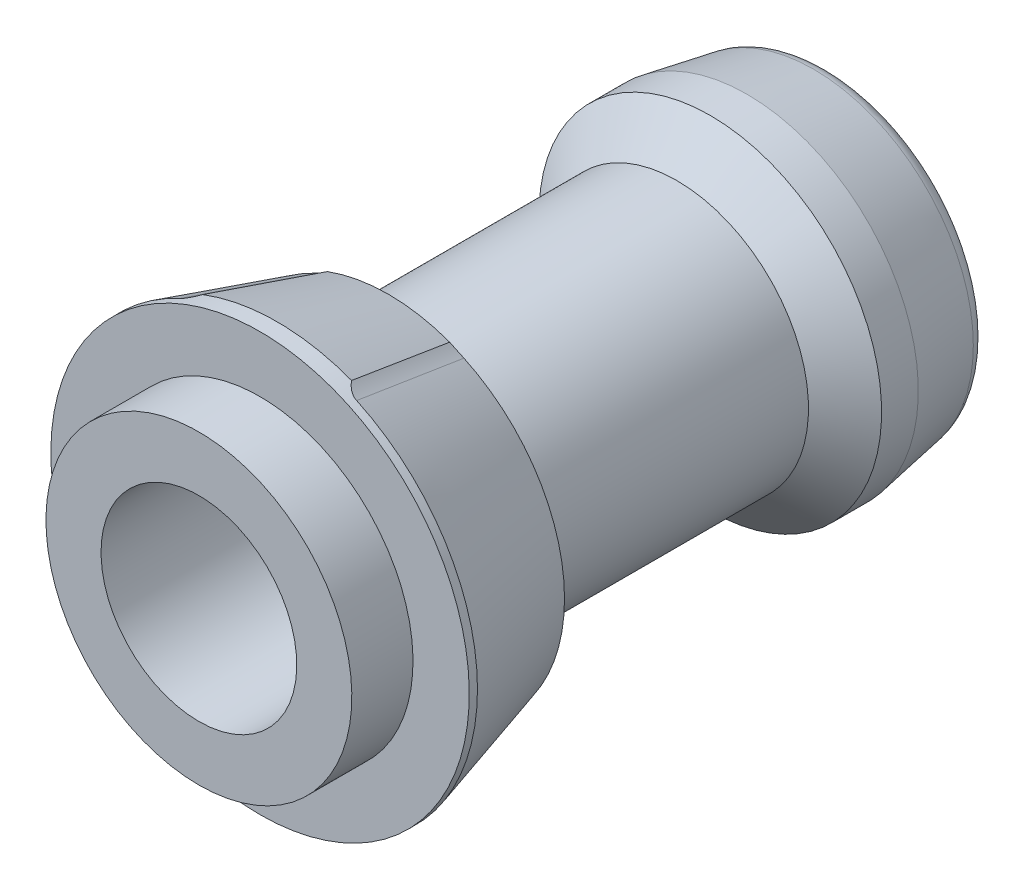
ISO-10303-21;
HEADER;
FILE_DESCRIPTION(('STEP AP214'),'2;1');
FILE_NAME('part.step','',(''),(''),'','','');
FILE_SCHEMA(('AUTOMOTIVE_DESIGN { 1 0 10303 214 1 1 1 1 }'));
ENDSEC;
DATA;
#1=APPLICATION_CONTEXT('core data for automotive mechanical design processes');
#2=APPLICATION_PROTOCOL_DEFINITION('international standard','automotive_design',2000,#1);
#3=PRODUCT_CONTEXT('',#1,'mechanical');
#4=PRODUCT('Part','Part','',(#3));
#5=PRODUCT_RELATED_PRODUCT_CATEGORY('part','',(#4));
#6=PRODUCT_DEFINITION_FORMATION('','',#4);
#7=PRODUCT_DEFINITION_CONTEXT('part definition',#1,'design');
#8=PRODUCT_DEFINITION('design','',#6,#7);
#9=PRODUCT_DEFINITION_SHAPE('','',#8);
#10=(LENGTH_UNIT() NAMED_UNIT(*) SI_UNIT(.MILLI.,.METRE.));
#11=(NAMED_UNIT(*) PLANE_ANGLE_UNIT() SI_UNIT($,.RADIAN.));
#12=(NAMED_UNIT(*) SI_UNIT($,.STERADIAN.) SOLID_ANGLE_UNIT());
#13=UNCERTAINTY_MEASURE_WITH_UNIT(LENGTH_MEASURE(1.E-05),#10,'distance_accuracy_value','');
#14=(GEOMETRIC_REPRESENTATION_CONTEXT(3) GLOBAL_UNCERTAINTY_ASSIGNED_CONTEXT((#13)) GLOBAL_UNIT_ASSIGNED_CONTEXT((#10,
#11,#12)) REPRESENTATION_CONTEXT('',''));
#15=CARTESIAN_POINT('',(0.,0.,0.));
#16=DIRECTION('',(0.,0.,1.));
#17=DIRECTION('',(1.,0.,0.));
#18=AXIS2_PLACEMENT_3D('',#15,#16,#17);
#19=CARTESIAN_POINT('',(0.,0.,5.));
#20=DIRECTION('',(0.,0.,1.));
#21=DIRECTION('',(0.,-1.,0.));
#22=AXIS2_PLACEMENT_3D('',#19,#20,#21);
#23=CYLINDRICAL_SURFACE('',#22,7.);
#24=CARTESIAN_POINT('',(0.,0.,-25.));
#25=DIRECTION('',(0.,0.,1.));
#26=DIRECTION('',(0.,-1.,0.));
#27=AXIS2_PLACEMENT_3D('',#24,#25,#26);
#28=CIRCLE('',#27,7.);
#29=CARTESIAN_POINT('',(0.,-6.99999999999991,-25.));
#30=VERTEX_POINT('',#29);
#31=EDGE_CURVE('E321',#30,#30,#28,.T.);
#32=ORIENTED_EDGE('',*,*,#31,.T.);
#33=EDGE_LOOP('',(#32));
#34=FACE_BOUND('',#33,.T.);
#35=CARTESIAN_POINT('',(0.,1.08235921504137E-13,-31.));
#36=DIRECTION('',(0.,0.,-1.));
#37=DIRECTION('',(1.,0.,0.));
#38=AXIS2_PLACEMENT_3D('',#35,#36,#37);
#39=CIRCLE('',#38,7.);
#40=CARTESIAN_POINT('',(7.,1.08235921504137E-13,-31.));
#41=VERTEX_POINT('',#40);
#42=EDGE_CURVE('E9',#41,#41,#39,.F.);
#43=ORIENTED_EDGE('',*,*,#42,.F.);
#44=EDGE_LOOP('',(#43));
#45=FACE_BOUND('',#44,.T.);
#46=ADVANCED_FACE('F14',(#34,#45),#23,.F.);
#47=CARTESIAN_POINT('',(0.,0.,0.));
#48=DIRECTION('',(0.,0.,-1.));
#49=DIRECTION('',(0.,1.,0.));
#50=AXIS2_PLACEMENT_3D('',#47,#48,#49);
#51=CYLINDRICAL_SURFACE('',#50,17.1);
#52=CARTESIAN_POINT('',(0.,0.,0.));
#53=DIRECTION('',(0.,0.,1.));
#54=DIRECTION('',(0.,-1.,0.));
#55=AXIS2_PLACEMENT_3D('',#52,#53,#54);
#56=CIRCLE('',#55,17.1);
#57=CARTESIAN_POINT('',(0.,-17.1,0.));
#58=VERTEX_POINT('',#57);
#59=EDGE_CURVE('E349',#58,#58,#56,.F.);
#60=ORIENTED_EDGE('',*,*,#59,.T.);
#61=EDGE_LOOP('',(#60));
#62=FACE_BOUND('',#61,.T.);
#63=CARTESIAN_POINT('',(0.,0.,-1.3949657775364));
#64=DIRECTION('',(0.,0.,-1.));
#65=DIRECTION('',(0.,1.,0.));
#66=AXIS2_PLACEMENT_3D('',#63,#64,#65);
#67=CIRCLE('',#66,17.1);
#68=CARTESIAN_POINT('',(-6.08241428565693,15.9816844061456,-1.39496577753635));
#69=VERTEX_POINT('',#68);
#70=CARTESIAN_POINT('',(6.08241428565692,15.9816844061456,-1.39496577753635));
#71=VERTEX_POINT('',#70);
#72=EDGE_CURVE('E331',#69,#71,#67,.T.);
#73=ORIENTED_EDGE('',*,*,#72,.F.);
#74=CARTESIAN_POINT('',(-6.08241428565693,15.9816844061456,-1.39496577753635));
#75=CARTESIAN_POINT('',(-6.11358364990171,15.9698208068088,-1.35559954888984));
#76=CARTESIAN_POINT('',(-6.14546425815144,15.9575841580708,-1.31691915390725));
#77=CARTESIAN_POINT('',(-6.21088953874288,15.9322342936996,-1.24117287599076));
#78=CARTESIAN_POINT('',(-6.24443696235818,15.919119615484,-1.20410986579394));
#79=CARTESIAN_POINT('',(-6.3489458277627,15.8778644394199,-1.09469106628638));
#80=CARTESIAN_POINT('',(-6.42273072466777,15.8482070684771,-1.02546248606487));
#81=CARTESIAN_POINT('',(-6.56178746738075,15.7910507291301,-0.913713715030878));
#82=CARTESIAN_POINT('',(-6.62538961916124,15.7644993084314,-0.86866394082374));
#83=CARTESIAN_POINT('',(-6.75771078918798,15.7082289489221,-0.790024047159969));
#84=CARTESIAN_POINT('',(-6.82639671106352,15.6785300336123,-0.756366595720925));
#85=CARTESIAN_POINT('',(-6.95174579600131,15.6232767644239,-0.710210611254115));
#86=CARTESIAN_POINT('',(-7.00753100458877,15.5983449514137,-0.694623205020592));
#87=CARTESIAN_POINT('',(-7.12045520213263,15.5471203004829,-0.673973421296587));
#88=CARTESIAN_POINT('',(-7.17759380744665,15.5208278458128,-0.668908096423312));
#89=CARTESIAN_POINT('',(-7.29156400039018,15.4676131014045,-0.669910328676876));
#90=CARTESIAN_POINT('',(-7.34839510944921,15.4406900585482,-0.675991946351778));
#91=CARTESIAN_POINT('',(-7.46001209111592,15.3870746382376,-0.698586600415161));
#92=CARTESIAN_POINT('',(-7.51479716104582,15.3603823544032,-0.715103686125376));
#93=CARTESIAN_POINT('',(-7.63943667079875,15.2988676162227,-0.764103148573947));
#94=CARTESIAN_POINT('',(-7.70805310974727,15.2643793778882,-0.800110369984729));
#95=CARTESIAN_POINT('',(-7.83923225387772,15.1974314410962,-0.883793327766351));
#96=CARTESIAN_POINT('',(-7.9017560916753,15.1649851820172,-0.93153790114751));
#97=CARTESIAN_POINT('',(-8.03102725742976,15.096980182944,-1.04391100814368));
#98=CARTESIAN_POINT('',(-8.096676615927,15.0618342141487,-1.11003032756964));
#99=CARTESIAN_POINT('',(-8.18946646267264,15.01145709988,-1.21408001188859));
#100=CARTESIAN_POINT('',(-8.2192291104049,14.9951783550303,-1.24926927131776));
#101=CARTESIAN_POINT('',(-8.27720907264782,14.9632516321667,-1.32109105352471));
#102=CARTESIAN_POINT('',(-8.30542837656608,14.9476028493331,-1.35772160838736));
#103=CARTESIAN_POINT('',(-8.33297999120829,14.932228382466,-1.39496577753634));
#104=B_SPLINE_CURVE_WITH_KNOTS('',3,(#74,#75,#76,#77,#78,#79,#80,#81,#82,#83,#84,#85,#86,#87,
#88,#89,#90,#91,#92,#93,#94,#95,#96,#97,#98,#99,#100,#101,#102,#103),.UNSPECIFIED.,.F.,.F.,(4,2,
2,2,2,2,2,2,2,2,2,2,2,2,4),(0.,0.154747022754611,0.309758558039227,0.625028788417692,
0.871317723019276,1.11612450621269,1.30450457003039,1.49283185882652,1.68139686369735,
1.87003508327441,2.12305130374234,2.37758837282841,2.67553132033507,2.82213393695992,
2.96854289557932),.UNSPECIFIED.);
#105=CARTESIAN_POINT('',(-7.22677227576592,15.4978631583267,-0.669374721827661));
#106=VERTEX_POINT('',#105);
#107=EDGE_CURVE('E181',#69,#106,#104,.T.);
#108=ORIENTED_EDGE('',*,*,#107,.T.);
#109=CARTESIAN_POINT('',(0.,0.,-0.669374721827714));
#110=DIRECTION('',(0.,0.,1.));
#111=DIRECTION('',(0.,-1.,0.));
#112=AXIS2_PLACEMENT_3D('',#109,#110,#111);
#113=CIRCLE('',#112,17.1);
#114=CARTESIAN_POINT('',(-7.22677227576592,-15.4978631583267,-0.669374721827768));
#115=VERTEX_POINT('',#114);
#116=EDGE_CURVE('E264',#115,#106,#113,.F.);
#117=ORIENTED_EDGE('',*,*,#116,.F.);
#118=CARTESIAN_POINT('',(-8.33297999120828,-14.932228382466,-1.39496577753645));
#119=CARTESIAN_POINT('',(-8.30385666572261,-14.9484797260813,-1.35559954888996));
#120=CARTESIAN_POINT('',(-8.27399038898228,-14.9650361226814,-1.31691915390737));
#121=CARTESIAN_POINT('',(-8.21251670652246,-14.9988602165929,-1.24117287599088));
#122=CARTESIAN_POINT('',(-8.18090641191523,-15.0161290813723,-1.20410986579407));
#123=CARTESIAN_POINT('',(-8.08212610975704,-15.0696692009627,-1.09469106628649));
#124=CARTESIAN_POINT('',(-8.01197922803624,-15.107128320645,-1.02546248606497));
#125=CARTESIAN_POINT('',(-7.87881098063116,-15.1769125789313,-0.913713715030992));
#126=CARTESIAN_POINT('',(-7.8175887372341,-15.2085677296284,-0.868663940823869));
#127=CARTESIAN_POINT('',(-7.68942873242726,-15.2737617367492,-0.790024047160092));
#128=CARTESIAN_POINT('',(-7.62252758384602,-15.3072881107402,-0.756366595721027));
#129=CARTESIAN_POINT('',(-7.49962828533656,-15.3677949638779,-0.71021061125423));
#130=CARTESIAN_POINT('',(-7.4446713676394,-15.3945030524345,-0.694623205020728));
#131=CARTESIAN_POINT('',(-7.33284473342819,-15.4480814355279,-0.67397342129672));
#132=CARTESIAN_POINT('',(-7.27597555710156,-15.474951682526,-0.66890809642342));
#133=CARTESIAN_POINT('',(-7.16195206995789,-15.5280521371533,-0.669910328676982));
#134=CARTESIAN_POINT('',(-7.10479748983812,-15.5542814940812,-0.675991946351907));
#135=CARTESIAN_POINT('',(-6.99197968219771,-15.6053217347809,-0.698586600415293));
#136=CARTESIAN_POINT('',(-6.93631704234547,-15.6301320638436,-0.715103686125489));
#137=CARTESIAN_POINT('',(-6.80907728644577,-15.6860705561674,-0.764103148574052));
#138=CARTESIAN_POINT('',(-6.73855196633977,-15.7164651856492,-0.80011036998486));
#139=CARTESIAN_POINT('',(-6.60294654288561,-15.7739209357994,-0.88379332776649));
#140=CARTESIAN_POINT('',(-6.53790171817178,-15.80096092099,-0.931537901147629));
#141=CARTESIAN_POINT('',(-6.40271296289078,-15.8562756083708,-1.04391100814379));
#142=CARTESIAN_POINT('',(-6.33359099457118,-15.8839745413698,-1.11003032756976));
#143=CARTESIAN_POINT('',(-6.23535572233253,-15.9226739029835,-1.21408001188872));
#144=CARTESIAN_POINT('',(-6.20375441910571,-15.9350096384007,-1.24926927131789));
#145=CARTESIAN_POINT('',(-6.14202832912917,-15.9589027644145,-1.32109105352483));
#146=CARTESIAN_POINT('',(-6.11190164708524,-15.9704611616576,-1.35772160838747));
#147=CARTESIAN_POINT('',(-6.08241428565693,-15.9816844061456,-1.39496577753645));
#148=B_SPLINE_CURVE_WITH_KNOTS('',3,(#118,#119,#120,#121,#122,#123,#124,#125,#126,#127,#128,
#129,#130,#131,#132,#133,#134,#135,#136,#137,#138,#139,#140,#141,#142,#143,#144,#145,#146,#147),
.UNSPECIFIED.,.F.,.F.,(4,2,2,2,2,2,2,2,2,2,2,2,2,2,4),(0.,0.154747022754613,0.309758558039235,
0.625028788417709,0.871317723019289,1.1161245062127,1.30450457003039,1.49283185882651,
1.68139686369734,1.8700350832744,2.12305130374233,2.37758837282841,2.67553132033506,
2.82213393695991,2.9685428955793),.UNSPECIFIED.);
#149=CARTESIAN_POINT('',(-6.08241428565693,-15.9816844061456,-1.39496577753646));
#150=VERTEX_POINT('',#149);
#151=EDGE_CURVE('E250',#115,#150,#148,.T.);
#152=ORIENTED_EDGE('',*,*,#151,.T.);
#153=CARTESIAN_POINT('',(6.08241428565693,-15.9816844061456,-1.39496577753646));
#154=VERTEX_POINT('',#153);
#155=EDGE_CURVE('E332',#154,#150,#67,.T.);
#156=ORIENTED_EDGE('',*,*,#155,.F.);
#157=CARTESIAN_POINT('',(6.08241428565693,-15.9816844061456,-1.39496577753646));
#158=CARTESIAN_POINT('',(6.11358364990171,-15.9698208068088,-1.35559954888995));
#159=CARTESIAN_POINT('',(6.14546425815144,-15.9575841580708,-1.31691915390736));
#160=CARTESIAN_POINT('',(6.21088953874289,-15.9322342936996,-1.24117287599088));
#161=CARTESIAN_POINT('',(6.24443696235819,-15.9191196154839,-1.20410986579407));
#162=CARTESIAN_POINT('',(6.34894582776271,-15.8778644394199,-1.0946910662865));
#163=CARTESIAN_POINT('',(6.42273072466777,-15.8482070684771,-1.02546248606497));
#164=CARTESIAN_POINT('',(6.56178746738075,-15.7910507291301,-0.913713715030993));
#165=CARTESIAN_POINT('',(6.62538961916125,-15.7644993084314,-0.868663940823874));
#166=CARTESIAN_POINT('',(6.75771078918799,-15.7082289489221,-0.790024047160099));
#167=CARTESIAN_POINT('',(6.82639671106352,-15.6785300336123,-0.756366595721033));
#168=CARTESIAN_POINT('',(6.95174579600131,-15.6232767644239,-0.710210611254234));
#169=CARTESIAN_POINT('',(7.00753100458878,-15.5983449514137,-0.694623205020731));
#170=CARTESIAN_POINT('',(7.12045520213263,-15.5471203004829,-0.673973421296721));
#171=CARTESIAN_POINT('',(7.17759380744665,-15.5208278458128,-0.668908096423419));
#172=CARTESIAN_POINT('',(7.29156400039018,-15.4676131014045,-0.669910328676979));
#173=CARTESIAN_POINT('',(7.34839510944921,-15.4406900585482,-0.675991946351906));
#174=CARTESIAN_POINT('',(7.46001209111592,-15.3870746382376,-0.698586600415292));
#175=CARTESIAN_POINT('',(7.51479716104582,-15.3603823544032,-0.715103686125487));
#176=CARTESIAN_POINT('',(7.63943667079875,-15.2988676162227,-0.76410314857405));
#177=CARTESIAN_POINT('',(7.70805310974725,-15.2643793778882,-0.800110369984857));
#178=CARTESIAN_POINT('',(7.8392322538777,-15.1974314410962,-0.883793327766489));
#179=CARTESIAN_POINT('',(7.90175609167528,-15.1649851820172,-0.931537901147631));
#180=CARTESIAN_POINT('',(8.03102725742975,-15.096980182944,-1.04391100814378));
#181=CARTESIAN_POINT('',(8.096676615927,-15.0618342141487,-1.11003032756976));
#182=CARTESIAN_POINT('',(8.18946646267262,-15.01145709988,-1.21408001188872));
#183=CARTESIAN_POINT('',(8.21922911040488,-14.9951783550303,-1.24926927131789));
#184=CARTESIAN_POINT('',(8.2772090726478,-14.9632516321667,-1.32109105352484));
#185=CARTESIAN_POINT('',(8.30542837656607,-14.947602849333,-1.35772160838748));
#186=CARTESIAN_POINT('',(8.33297999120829,-14.932228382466,-1.39496577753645));
#187=B_SPLINE_CURVE_WITH_KNOTS('',3,(#157,#158,#159,#160,#161,#162,#163,#164,#165,#166,#167,
#168,#169,#170,#171,#172,#173,#174,#175,#176,#177,#178,#179,#180,#181,#182,#183,#184,#185,#186),
.UNSPECIFIED.,.F.,.F.,(4,2,2,2,2,2,2,2,2,2,2,2,2,2,4),(0.,0.154747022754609,0.309758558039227,
0.625028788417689,0.87131772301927,1.11612450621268,1.30450457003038,1.49283185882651,
1.68139686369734,1.8700350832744,2.12305130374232,2.37758837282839,2.67553132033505,
2.8221339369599,2.9685428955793),.UNSPECIFIED.);
#188=CARTESIAN_POINT('',(7.22677227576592,-15.4978631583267,-0.669374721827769));
#189=VERTEX_POINT('',#188);
#190=EDGE_CURVE('E281',#154,#189,#187,.T.);
#191=ORIENTED_EDGE('',*,*,#190,.T.);
#192=CARTESIAN_POINT('',(0.,0.,-0.669374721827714));
#193=DIRECTION('',(0.,0.,1.));
#194=DIRECTION('',(0.,-1.,0.));
#195=AXIS2_PLACEMENT_3D('',#192,#193,#194);
#196=CIRCLE('',#195,17.1);
#197=CARTESIAN_POINT('',(7.22677227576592,15.4978631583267,-0.66937472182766));
#198=VERTEX_POINT('',#197);
#199=EDGE_CURVE('E303',#198,#189,#196,.F.);
#200=ORIENTED_EDGE('',*,*,#199,.F.);
#201=CARTESIAN_POINT('',(8.33297999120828,14.932228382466,-1.39496577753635));
#202=CARTESIAN_POINT('',(8.30385666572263,14.9484797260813,-1.35559954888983));
#203=CARTESIAN_POINT('',(8.27399038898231,14.9650361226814,-1.31691915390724));
#204=CARTESIAN_POINT('',(8.21251670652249,14.9988602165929,-1.24117287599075));
#205=CARTESIAN_POINT('',(8.18090641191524,15.0161290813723,-1.20410986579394));
#206=CARTESIAN_POINT('',(8.08212610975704,15.0696692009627,-1.09469106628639));
#207=CARTESIAN_POINT('',(8.01197922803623,15.107128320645,-1.02546248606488));
#208=CARTESIAN_POINT('',(7.87881098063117,15.1769125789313,-0.913713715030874));
#209=CARTESIAN_POINT('',(7.81758873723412,15.2085677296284,-0.868663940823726));
#210=CARTESIAN_POINT('',(7.68942873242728,15.2737617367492,-0.790024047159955));
#211=CARTESIAN_POINT('',(7.62252758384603,15.3072881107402,-0.756366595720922));
#212=CARTESIAN_POINT('',(7.49962828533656,15.3677949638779,-0.71021061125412));
#213=CARTESIAN_POINT('',(7.4446713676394,15.3945030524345,-0.694623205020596));
#214=CARTESIAN_POINT('',(7.3328447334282,15.4480814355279,-0.673973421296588));
#215=CARTESIAN_POINT('',(7.27597555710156,15.474951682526,-0.668908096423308));
#216=CARTESIAN_POINT('',(7.16195206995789,15.5280521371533,-0.66991032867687));
#217=CARTESIAN_POINT('',(7.10479748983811,15.5542814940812,-0.675991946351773));
#218=CARTESIAN_POINT('',(6.99197968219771,15.6053217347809,-0.698586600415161));
#219=CARTESIAN_POINT('',(6.93631704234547,15.6301320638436,-0.715103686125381));
#220=CARTESIAN_POINT('',(6.80907728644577,15.6860705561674,-0.764103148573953));
#221=CARTESIAN_POINT('',(6.73855196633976,15.7164651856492,-0.800110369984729));
#222=CARTESIAN_POINT('',(6.6029465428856,15.7739209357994,-0.883793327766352));
#223=CARTESIAN_POINT('',(6.53790171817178,15.80096092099,-0.931537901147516));
#224=CARTESIAN_POINT('',(6.40271296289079,15.8562756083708,-1.04391100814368));
#225=CARTESIAN_POINT('',(6.33359099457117,15.8839745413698,-1.11003032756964));
#226=CARTESIAN_POINT('',(6.23535572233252,15.9226739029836,-1.21408001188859));
#227=CARTESIAN_POINT('',(6.2037544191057,15.9350096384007,-1.24926927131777));
#228=CARTESIAN_POINT('',(6.14202832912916,15.9589027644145,-1.32109105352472));
#229=CARTESIAN_POINT('',(6.11190164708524,15.9704611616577,-1.35772160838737));
#230=CARTESIAN_POINT('',(6.08241428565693,15.9816844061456,-1.39496577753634));
#231=B_SPLINE_CURVE_WITH_KNOTS('',3,(#201,#202,#203,#204,#205,#206,#207,#208,#209,#210,#211,
#212,#213,#214,#215,#216,#217,#218,#219,#220,#221,#222,#223,#224,#225,#226,#227,#228,#229,#230),
.UNSPECIFIED.,.F.,.F.,(4,2,2,2,2,2,2,2,2,2,2,2,2,2,4),(0.,0.154747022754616,0.309758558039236,
0.625028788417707,0.871317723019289,1.11612450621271,1.3045045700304,1.49283185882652,
1.68139686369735,1.87003508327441,2.12305130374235,2.37758837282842,2.67553132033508,
2.82213393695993,2.96854289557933),.UNSPECIFIED.);
#232=EDGE_CURVE('E39',#198,#71,#231,.T.);
#233=ORIENTED_EDGE('',*,*,#232,.T.);
#234=EDGE_LOOP('',(#73,#108,#117,#152,#156,#191,#200,#233));
#235=FACE_BOUND('',#234,.T.);
#236=ADVANCED_FACE('F219',(#62,#235),#51,.T.);
#237=CARTESIAN_POINT('',(0.,0.,-12.6588127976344));
#238=DIRECTION('',(0.,0.,1.));
#239=DIRECTION('',(0.,-1.,0.));
#240=AXIS2_PLACEMENT_3D('',#237,#238,#239);
#241=CONICAL_SURFACE('',#240,10.75,1.0471975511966);
#242=CARTESIAN_POINT('',(0.,0.,-12.6588127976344));
#243=DIRECTION('',(0.,0.,1.));
#244=DIRECTION('',(0.,-1.,0.));
#245=AXIS2_PLACEMENT_3D('',#242,#243,#244);
#246=CIRCLE('',#245,10.75);
#247=CARTESIAN_POINT('',(0.,-10.75,-12.6588127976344));
#248=VERTEX_POINT('',#247);
#249=EDGE_CURVE('E340',#248,#248,#246,.T.);
#250=ORIENTED_EDGE('',*,*,#249,.T.);
#251=EDGE_LOOP('',(#250));
#252=FACE_BOUND('',#251,.T.);
#253=CARTESIAN_POINT('',(-3.99844389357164,15.0041069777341,-9.90038201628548));
#254=CARTESIAN_POINT('',(-4.04739117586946,14.8991954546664,-9.95162523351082));
#255=CARTESIAN_POINT('',(-4.10004476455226,14.7953754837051,-10.0014157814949));
#256=CARTESIAN_POINT('',(-4.21352119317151,14.5902349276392,-10.0975505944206));
#257=CARTESIAN_POINT('',(-4.27436556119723,14.4889217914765,-10.1438852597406));
#258=CARTESIAN_POINT('',(-4.46887448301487,14.1916322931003,-10.275787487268));
#259=CARTESIAN_POINT('',(-4.61527124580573,14.0006265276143,-10.3550854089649));
#260=CARTESIAN_POINT('',(-4.81387737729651,13.7836062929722,-10.4360304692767));
#261=CARTESIAN_POINT('',(-4.84936155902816,13.7462230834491,-10.4496127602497));
#262=CARTESIAN_POINT('',(-4.92194725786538,13.6725577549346,-10.4756078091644));
#263=CARTESIAN_POINT('',(-4.95905044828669,13.6362768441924,-10.4880193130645));
#264=CARTESIAN_POINT('',(-5.12583118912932,13.4793604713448,-10.5398475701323));
#265=CARTESIAN_POINT('',(-5.2640219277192,13.3652005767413,-10.5726053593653));
#266=CARTESIAN_POINT('',(-5.55708358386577,13.1558525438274,-10.6205927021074));
#267=CARTESIAN_POINT('',(-5.71196846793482,13.0606804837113,-10.6358074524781));
#268=CARTESIAN_POINT('',(-6.03482989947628,12.8930827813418,-10.6471023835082));
#269=CARTESIAN_POINT('',(-6.20284173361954,12.8207212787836,-10.6431291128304));
#270=CARTESIAN_POINT('',(-6.54595567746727,12.7011812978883,-10.6163469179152));
#271=CARTESIAN_POINT('',(-6.72104913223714,12.6539730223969,-10.5935603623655));
#272=CARTESIAN_POINT('',(-6.94841778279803,12.6088661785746,-10.5534599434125));
#273=CARTESIAN_POINT('',(-7.00006673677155,12.5996940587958,-10.5436535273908));
#274=CARTESIAN_POINT('',(-7.10337888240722,12.5834132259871,-10.5227089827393));
#275=CARTESIAN_POINT('',(-7.15504202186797,12.5763027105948,-10.5115720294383));
#276=CARTESIAN_POINT('',(-7.34009149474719,12.5544243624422,-10.4693917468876));
#277=CARTESIAN_POINT('',(-7.47337589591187,12.5453545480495,-10.4347460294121));
#278=CARTESIAN_POINT('',(-7.73823297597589,12.5395442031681,-10.3583269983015));
#279=CARTESIAN_POINT('',(-7.86980337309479,12.5428186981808,-10.3165450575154));
#280=CARTESIAN_POINT('',(-8.13088324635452,12.5605523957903,-10.226895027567));
#281=CARTESIAN_POINT('',(-8.26037699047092,12.5750743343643,-10.1789940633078));
#282=CARTESIAN_POINT('',(-8.51586981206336,12.6141793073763,-10.0784356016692));
#283=CARTESIAN_POINT('',(-8.64186964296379,12.6387601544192,-10.025779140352));
#284=CARTESIAN_POINT('',(-8.93036466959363,12.7063486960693,-9.89891218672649));
#285=CARTESIAN_POINT('',(-9.09142878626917,12.7527478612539,-9.82325382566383));
#286=CARTESIAN_POINT('',(-9.40647790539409,12.8592008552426,-9.66693044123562));
#287=CARTESIAN_POINT('',(-9.56045920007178,12.9192617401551,-9.58626284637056));
#288=CARTESIAN_POINT('',(-9.86097382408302,13.0512573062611,-9.42132469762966));
#289=CARTESIAN_POINT('',(-10.0075140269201,13.1231807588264,-9.33705760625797));
#290=CARTESIAN_POINT('',(-10.293194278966,13.2775492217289,-9.16586445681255));
#291=CARTESIAN_POINT('',(-10.4323373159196,13.359989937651,-9.0789394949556));
#292=CARTESIAN_POINT('',(-10.6595860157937,13.5062098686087,-8.93149353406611));
#293=CARTESIAN_POINT('',(-10.7496875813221,13.5674402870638,-8.87149179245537));
#294=CARTESIAN_POINT('',(-10.9262179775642,13.6937555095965,-8.75097655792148));
#295=CARTESIAN_POINT('',(-11.012657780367,13.7588271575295,-8.69046535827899));
#296=CARTESIAN_POINT('',(-11.0974181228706,13.8257816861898,-8.62968901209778));
#297=B_SPLINE_CURVE_WITH_KNOTS('',3,(#253,#254,#255,#256,#257,#258,#259,#260,#261,#262,#263,
#264,#265,#266,#267,#268,#269,#270,#271,#272,#273,#274,#275,#276,#277,#278,#279,#280,#281,#282,
#283,#284,#285,#286,#287,#288,#289,#290,#291,#292,#293,#294,#295,#296),.UNSPECIFIED.,.F.,.F.,(4,
2,2,2,2,2,2,2,2,2,2,2,2,2,2,2,2,2,2,2,2,4),(0.,0.379581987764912,0.760181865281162,
1.51537254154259,1.67524812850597,1.83529306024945,2.37935391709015,2.92387352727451,
3.46991085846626,4.01529989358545,4.17536806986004,4.33529588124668,4.74840437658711,
5.16201587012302,5.57795116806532,5.99379606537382,6.54463781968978,7.09576472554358,
7.64637291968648,8.19675700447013,8.56975740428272,8.94154707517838),.UNSPECIFIED.);
#298=CARTESIAN_POINT('',(-4.99760386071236,13.6000037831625,-10.5));
#299=VERTEX_POINT('',#298);
#300=CARTESIAN_POINT('',(-6.01801429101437,12.9056732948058,-10.6439556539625));
#301=VERTEX_POINT('',#300);
#302=EDGE_CURVE('E163',#299,#301,#297,.T.);
#303=ORIENTED_EDGE('',*,*,#302,.F.);
#304=CARTESIAN_POINT('',(0.,0.,-10.5));
#305=DIRECTION('',(0.,0.,-1.));
#306=DIRECTION('',(0.,1.,0.));
#307=AXIS2_PLACEMENT_3D('',#304,#305,#306);
#308=CIRCLE('',#307,14.4891734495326);
#309=CARTESIAN_POINT('',(4.99760386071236,13.6000037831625,-10.5));
#310=VERTEX_POINT('',#309);
#311=EDGE_CURVE('E327',#299,#310,#308,.T.);
#312=ORIENTED_EDGE('',*,*,#311,.T.);
#313=CARTESIAN_POINT('',(11.1664519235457,13.8810373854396,-8.57985546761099));
#314=CARTESIAN_POINT('',(11.0241014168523,13.7656652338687,-8.6832498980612));
#315=CARTESIAN_POINT('',(10.8768921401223,13.6555446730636,-8.78600856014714));
#316=CARTESIAN_POINT('',(10.5723570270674,13.4469939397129,-8.98954916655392));
#317=CARTESIAN_POINT('',(10.4150041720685,13.3485971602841,-9.09032481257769));
#318=CARTESIAN_POINT('',(10.0878392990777,13.1637944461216,-9.29027989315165));
#319=CARTESIAN_POINT('',(9.91786189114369,13.0776187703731,-9.38940372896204));
#320=CARTESIAN_POINT('',(9.56814720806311,12.9214965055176,-9.58262312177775));
#321=CARTESIAN_POINT('',(9.38842254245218,12.8515295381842,-9.67672487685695));
#322=CARTESIAN_POINT('',(8.99049891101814,12.720932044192,-9.87211644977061));
#323=CARTESIAN_POINT('',(8.77066660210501,12.6634516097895,-9.97224402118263));
#324=CARTESIAN_POINT('',(8.32051024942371,12.5793594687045,-10.158148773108));
#325=CARTESIAN_POINT('',(8.09026228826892,12.5525527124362,-10.2440136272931));
#326=CARTESIAN_POINT('',(7.7492406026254,12.5403968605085,-10.3544629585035));
#327=CARTESIAN_POINT('',(7.64147903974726,12.5404403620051,-10.3870059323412));
#328=CARTESIAN_POINT('',(7.42476804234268,12.5488801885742,-10.4472424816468));
#329=CARTESIAN_POINT('',(7.31581725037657,12.5572873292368,-10.474929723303));
#330=CARTESIAN_POINT('',(7.03084417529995,12.5909978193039,-10.5398738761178));
#331=CARTESIAN_POINT('',(6.85453572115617,12.6234882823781,-10.5726339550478));
#332=CARTESIAN_POINT('',(6.50582201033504,12.7134347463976,-10.6206019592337));
#333=CARTESIAN_POINT('',(6.33341697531,12.7708921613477,-10.6358088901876));
#334=CARTESIAN_POINT('',(5.9975681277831,12.9104575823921,-10.6471027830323));
#335=CARTESIAN_POINT('',(5.83415389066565,12.9926417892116,-10.6431300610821));
#336=CARTESIAN_POINT('',(5.52203095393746,13.1786412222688,-10.6163495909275));
#337=CARTESIAN_POINT('',(5.3733069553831,13.2824335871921,-10.5935616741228));
#338=CARTESIAN_POINT('',(5.19259440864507,13.4276200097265,-10.5534599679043));
#339=CARTESIAN_POINT('',(5.1523685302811,13.4612896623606,-10.5436536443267));
#340=CARTESIAN_POINT('',(5.07348722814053,13.5299689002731,-10.5227079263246));
#341=CARTESIAN_POINT('',(5.03483039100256,13.5649772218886,-10.5115697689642));
#342=CARTESIAN_POINT('',(4.93078953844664,13.6628692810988,-10.4792347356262));
#343=CARTESIAN_POINT('',(4.86702035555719,13.7270337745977,-10.4567411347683));
#344=CARTESIAN_POINT('',(4.64149255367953,13.9689539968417,-10.3676859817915));
#345=CARTESIAN_POINT('',(4.49454859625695,14.1569232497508,-10.2904285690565));
#346=CARTESIAN_POINT('',(4.29909270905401,14.4494399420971,-10.1616853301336));
#347=CARTESIAN_POINT('',(4.23800495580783,14.5489129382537,-10.1165260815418));
#348=CARTESIAN_POINT('',(4.12387100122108,14.7504179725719,-10.0227331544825));
#349=CARTESIAN_POINT('',(4.07080482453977,14.8524428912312,-9.97410856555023));
#350=CARTESIAN_POINT('',(4.02138112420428,14.9555680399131,-9.92402848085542));
#351=B_SPLINE_CURVE_WITH_KNOTS('',3,(#313,#314,#315,#316,#317,#318,#319,#320,#321,#322,#323,
#324,#325,#326,#327,#328,#329,#330,#331,#332,#333,#334,#335,#336,#337,#338,#339,#340,#341,#342,
#343,#344,#345,#346,#347,#348,#349,#350),.UNSPECIFIED.,.F.,.F.,(4,2,2,2,2,2,2,2,2,2,2,2,2,2,2,2,
2,2,4),(0.,0.631193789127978,1.26414449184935,1.9077718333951,2.55058553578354,3.2934901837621,
4.03164408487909,4.36899007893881,4.70677288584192,5.25104774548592,5.79535343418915,
6.34135400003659,6.88677980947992,7.04685157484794,7.20677579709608,7.48621067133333,
8.23378244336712,8.60905353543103,8.98337416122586),.UNSPECIFIED.);
#352=CARTESIAN_POINT('',(6.01801429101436,12.9056732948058,-10.6439556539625));
#353=VERTEX_POINT('',#352);
#354=EDGE_CURVE('E289',#353,#310,#351,.T.);
#355=ORIENTED_EDGE('',*,*,#354,.F.);
#356=CARTESIAN_POINT('',(0.,0.,-10.6439556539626));
#357=DIRECTION('',(0.,0.,-1.));
#358=DIRECTION('',(0.,1.,0.));
#359=AXIS2_PLACEMENT_3D('',#356,#357,#358);
#360=CIRCLE('',#359,14.2398349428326);
#361=CARTESIAN_POINT('',(6.01801429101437,-12.9056732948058,-10.6439556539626));
#362=VERTEX_POINT('',#361);
#363=EDGE_CURVE('E346',#353,#362,#360,.T.);
#364=ORIENTED_EDGE('',*,*,#363,.T.);
#365=CARTESIAN_POINT('',(3.99844389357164,-15.004106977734,-9.90038201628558));
#366=CARTESIAN_POINT('',(4.04739117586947,-14.8991954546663,-9.95162523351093));
#367=CARTESIAN_POINT('',(4.10004476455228,-14.795375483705,-10.001415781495));
#368=CARTESIAN_POINT('',(4.21352119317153,-14.5902349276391,-10.0975505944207));
#369=CARTESIAN_POINT('',(4.27436556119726,-14.4889217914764,-10.1438852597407));
#370=CARTESIAN_POINT('',(4.46887448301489,-14.1916322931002,-10.2757874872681));
#371=CARTESIAN_POINT('',(4.61527124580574,-14.0006265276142,-10.355085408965));
#372=CARTESIAN_POINT('',(4.81387737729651,-13.7836062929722,-10.4360304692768));
#373=CARTESIAN_POINT('',(4.84936155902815,-13.746223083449,-10.4496127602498));
#374=CARTESIAN_POINT('',(4.92194725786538,-13.6725577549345,-10.4756078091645));
#375=CARTESIAN_POINT('',(4.95905044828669,-13.6362768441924,-10.4880193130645));
#376=CARTESIAN_POINT('',(5.12583118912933,-13.4793604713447,-10.5398475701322));
#377=CARTESIAN_POINT('',(5.26402192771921,-13.3652005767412,-10.5726053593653));
#378=CARTESIAN_POINT('',(5.55708358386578,-13.1558525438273,-10.6205927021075));
#379=CARTESIAN_POINT('',(5.71196846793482,-13.0606804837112,-10.6358074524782));
#380=CARTESIAN_POINT('',(6.03482989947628,-12.8930827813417,-10.6471023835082));
#381=CARTESIAN_POINT('',(6.20284173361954,-12.8207212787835,-10.6431291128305));
#382=CARTESIAN_POINT('',(6.54595567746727,-12.7011812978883,-10.6163469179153));
#383=CARTESIAN_POINT('',(6.72104913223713,-12.6539730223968,-10.5935603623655));
#384=CARTESIAN_POINT('',(6.94841778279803,-12.6088661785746,-10.5534599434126));
#385=CARTESIAN_POINT('',(7.00006673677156,-12.5996940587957,-10.5436535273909));
#386=CARTESIAN_POINT('',(7.10337888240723,-12.5834132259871,-10.5227089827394));
#387=CARTESIAN_POINT('',(7.15504202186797,-12.5763027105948,-10.5115720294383));
#388=CARTESIAN_POINT('',(7.34009149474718,-12.5544243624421,-10.4693917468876));
#389=CARTESIAN_POINT('',(7.47337589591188,-12.5453545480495,-10.4347460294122));
#390=CARTESIAN_POINT('',(7.73823297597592,-12.539544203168,-10.3583269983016));
#391=CARTESIAN_POINT('',(7.86980337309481,-12.5428186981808,-10.3165450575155));
#392=CARTESIAN_POINT('',(8.13088324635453,-12.5605523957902,-10.2268950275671));
#393=CARTESIAN_POINT('',(8.26037699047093,-12.5750743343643,-10.1789940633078));
#394=CARTESIAN_POINT('',(8.51586981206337,-12.6141793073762,-10.0784356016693));
#395=CARTESIAN_POINT('',(8.6418696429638,-12.6387601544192,-10.025779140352));
#396=CARTESIAN_POINT('',(8.93036466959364,-12.7063486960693,-9.89891218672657));
#397=CARTESIAN_POINT('',(9.09142878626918,-12.7527478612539,-9.82325382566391));
#398=CARTESIAN_POINT('',(9.40647790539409,-12.8592008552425,-9.6669304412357));
#399=CARTESIAN_POINT('',(9.56045920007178,-12.9192617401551,-9.58626284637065));
#400=CARTESIAN_POINT('',(9.86097382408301,-13.0512573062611,-9.42132469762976));
#401=CARTESIAN_POINT('',(10.00751402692,-13.1231807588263,-9.33705760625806));
#402=CARTESIAN_POINT('',(10.293194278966,-13.2775492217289,-9.16586445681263));
#403=CARTESIAN_POINT('',(10.4323373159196,-13.3599899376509,-9.07893949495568));
#404=CARTESIAN_POINT('',(10.6595860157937,-13.5062098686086,-8.9314935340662));
#405=CARTESIAN_POINT('',(10.7496875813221,-13.5674402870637,-8.87149179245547));
#406=CARTESIAN_POINT('',(10.9262179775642,-13.6937555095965,-8.75097655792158));
#407=CARTESIAN_POINT('',(11.012657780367,-13.7588271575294,-8.69046535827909));
#408=CARTESIAN_POINT('',(11.0974181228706,-13.8257816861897,-8.62968901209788));
#409=B_SPLINE_CURVE_WITH_KNOTS('',3,(#365,#366,#367,#368,#369,#370,#371,#372,#373,#374,#375,
#376,#377,#378,#379,#380,#381,#382,#383,#384,#385,#386,#387,#388,#389,#390,#391,#392,#393,#394,
#395,#396,#397,#398,#399,#400,#401,#402,#403,#404,#405,#406,#407,#408),.UNSPECIFIED.,.F.,.F.,(4,
2,2,2,2,2,2,2,2,2,2,2,2,2,2,2,2,2,2,2,2,4),(0.,0.379581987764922,0.760181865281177,
1.51537254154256,1.67524812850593,1.83529306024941,2.37935391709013,2.9238735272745,
3.46991085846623,4.01529989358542,4.17536806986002,4.33529588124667,4.7484043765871,
5.16201587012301,5.5779511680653,5.99379606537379,6.54463781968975,7.09576472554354,
7.64637291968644,8.19675700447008,8.56975740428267,8.94154707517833),.UNSPECIFIED.);
#410=CARTESIAN_POINT('',(4.99760386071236,-13.6000037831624,-10.5));
#411=VERTEX_POINT('',#410);
#412=EDGE_CURVE('E266',#411,#362,#409,.T.);
#413=ORIENTED_EDGE('',*,*,#412,.F.);
#414=CARTESIAN_POINT('',(-4.99760386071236,-13.6000037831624,-10.5));
#415=VERTEX_POINT('',#414);
#416=EDGE_CURVE('E328',#411,#415,#308,.T.);
#417=ORIENTED_EDGE('',*,*,#416,.T.);
#418=CARTESIAN_POINT('',(-11.1664519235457,-13.8810373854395,-8.57985546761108));
#419=CARTESIAN_POINT('',(-11.0241014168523,-13.7656652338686,-8.68324989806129));
#420=CARTESIAN_POINT('',(-10.8768921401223,-13.6555446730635,-8.78600856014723));
#421=CARTESIAN_POINT('',(-10.5723570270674,-13.4469939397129,-8.98954916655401));
#422=CARTESIAN_POINT('',(-10.4150041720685,-13.3485971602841,-9.09032481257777));
#423=CARTESIAN_POINT('',(-10.0878392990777,-13.1637944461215,-9.29027989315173));
#424=CARTESIAN_POINT('',(-9.91786189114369,-13.077618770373,-9.38940372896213));
#425=CARTESIAN_POINT('',(-9.56814720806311,-12.9214965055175,-9.58262312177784));
#426=CARTESIAN_POINT('',(-9.38842254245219,-12.8515295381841,-9.67672487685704));
#427=CARTESIAN_POINT('',(-8.99049891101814,-12.720932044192,-9.8721164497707));
#428=CARTESIAN_POINT('',(-8.77066660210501,-12.6634516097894,-9.97224402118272));
#429=CARTESIAN_POINT('',(-8.32051024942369,-12.5793594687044,-10.158148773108));
#430=CARTESIAN_POINT('',(-8.09026228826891,-12.5525527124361,-10.2440136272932));
#431=CARTESIAN_POINT('',(-7.74924060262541,-12.5403968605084,-10.3544629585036));
#432=CARTESIAN_POINT('',(-7.64147903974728,-12.540440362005,-10.3870059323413));
#433=CARTESIAN_POINT('',(-7.42476804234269,-12.5488801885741,-10.4472424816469));
#434=CARTESIAN_POINT('',(-7.31581725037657,-12.5572873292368,-10.474929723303));
#435=CARTESIAN_POINT('',(-7.03084417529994,-12.5909978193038,-10.5398738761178));
#436=CARTESIAN_POINT('',(-6.85453572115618,-12.6234882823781,-10.5726339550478));
#437=CARTESIAN_POINT('',(-6.50582201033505,-12.7134347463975,-10.6206019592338));
#438=CARTESIAN_POINT('',(-6.33341697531,-12.7708921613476,-10.6358088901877));
#439=CARTESIAN_POINT('',(-5.9975681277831,-12.910457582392,-10.6471027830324));
#440=CARTESIAN_POINT('',(-5.83415389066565,-12.9926417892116,-10.6431300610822));
#441=CARTESIAN_POINT('',(-5.52203095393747,-13.1786412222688,-10.6163495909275));
#442=CARTESIAN_POINT('',(-5.37330695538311,-13.2824335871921,-10.5935616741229));
#443=CARTESIAN_POINT('',(-5.19259440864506,-13.4276200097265,-10.5534599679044));
#444=CARTESIAN_POINT('',(-5.1523685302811,-13.4612896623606,-10.5436536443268));
#445=CARTESIAN_POINT('',(-5.07348722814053,-13.529968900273,-10.5227079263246));
#446=CARTESIAN_POINT('',(-5.03483039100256,-13.5649772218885,-10.5115697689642));
#447=CARTESIAN_POINT('',(-4.93078953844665,-13.6628692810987,-10.4792347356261));
#448=CARTESIAN_POINT('',(-4.86702035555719,-13.7270337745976,-10.4567411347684));
#449=CARTESIAN_POINT('',(-4.64149255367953,-13.9689539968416,-10.3676859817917));
#450=CARTESIAN_POINT('',(-4.49454859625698,-14.1569232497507,-10.2904285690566));
#451=CARTESIAN_POINT('',(-4.29909270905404,-14.449439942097,-10.1616853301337));
#452=CARTESIAN_POINT('',(-4.23800495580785,-14.5489129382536,-10.1165260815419));
#453=CARTESIAN_POINT('',(-4.12387100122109,-14.7504179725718,-10.0227331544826));
#454=CARTESIAN_POINT('',(-4.07080482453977,-14.8524428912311,-9.97410856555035));
#455=CARTESIAN_POINT('',(-4.02138112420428,-14.955568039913,-9.92402848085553));
#456=B_SPLINE_CURVE_WITH_KNOTS('',3,(#418,#419,#420,#421,#422,#423,#424,#425,#426,#427,#428,
#429,#430,#431,#432,#433,#434,#435,#436,#437,#438,#439,#440,#441,#442,#443,#444,#445,#446,#447,
#448,#449,#450,#451,#452,#453,#454,#455),.UNSPECIFIED.,.F.,.F.,(4,2,2,2,2,2,2,2,2,2,2,2,2,2,2,2,
2,2,4),(0.,0.631193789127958,1.26414449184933,1.90777183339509,2.55058553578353,
3.29349018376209,4.03164408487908,4.36899007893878,4.70677288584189,5.25104774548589,
5.79535343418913,6.34135400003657,6.88677980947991,7.04685157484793,7.20677579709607,
7.4862106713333,8.23378244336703,8.60905353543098,8.98337416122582),.UNSPECIFIED.);
#457=CARTESIAN_POINT('',(-6.01801429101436,-12.9056732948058,-10.6439556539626));
#458=VERTEX_POINT('',#457);
#459=EDGE_CURVE('E251',#458,#415,#456,.T.);
#460=ORIENTED_EDGE('',*,*,#459,.F.);
#461=CARTESIAN_POINT('',(0.,0.,-10.6439556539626));
#462=DIRECTION('',(0.,0.,-1.));
#463=DIRECTION('',(0.,1.,0.));
#464=AXIS2_PLACEMENT_3D('',#461,#462,#463);
#465=CIRCLE('',#464,14.2398349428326);
#466=EDGE_CURVE('E23',#458,#301,#465,.T.);
#467=ORIENTED_EDGE('',*,*,#466,.T.);
#468=EDGE_LOOP('',(#303,#312,#355,#364,#413,#417,#460,#467));
#469=FACE_BOUND('',#468,.T.);
#470=ADVANCED_FACE('F188',(#252,#469),#241,.T.);
#471=CARTESIAN_POINT('',(0.,0.,-10.5));
#472=DIRECTION('',(0.,0.,1.));
#473=DIRECTION('',(0.,-1.,0.));
#474=AXIS2_PLACEMENT_3D('',#471,#472,#473);
#475=CONICAL_SURFACE('',#474,14.4891734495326,0.279252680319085);
#476=ORIENTED_EDGE('',*,*,#311,.F.);
#477=CARTESIAN_POINT('',(-4.99758009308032,13.5999514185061,-10.5002));
#478=CARTESIAN_POINT('',(-5.1779537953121,13.9972526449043,-8.98266383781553));
#479=CARTESIAN_POINT('',(-5.3585454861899,14.3943853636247,-7.46510956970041));
#480=CARTESIAN_POINT('',(-5.72016484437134,15.1883137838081,-4.42996482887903));
#481=CARTESIAN_POINT('',(-5.9011925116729,15.5851094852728,-2.91237435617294));
#482=CARTESIAN_POINT('',(-6.08243816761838,15.9817366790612,-1.39476577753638));
#483=B_SPLINE_CURVE_WITH_KNOTS('',3,(#477,#478,#479,#480,#481,#482),.UNSPECIFIED.,.F.,.F.,(4,2,
4),(0.,4.73705482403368,9.47410962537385),.UNSPECIFIED.);
#484=EDGE_CURVE('E204',#299,#69,#483,.T.);
#485=ORIENTED_EDGE('',*,*,#484,.T.);
#486=ORIENTED_EDGE('',*,*,#72,.T.);
#487=CARTESIAN_POINT('',(6.082438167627,15.9817366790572,-1.39476577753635));
#488=CARTESIAN_POINT('',(5.90119251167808,15.5851094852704,-2.91237435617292));
#489=CARTESIAN_POINT('',(5.72016484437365,15.188313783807,-4.42996482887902));
#490=CARTESIAN_POINT('',(5.3585454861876,14.3943853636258,-7.46510956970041));
#491=CARTESIAN_POINT('',(5.17795379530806,13.9972526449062,-8.98266383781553));
#492=CARTESIAN_POINT('',(4.9975800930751,13.5999514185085,-10.5002));
#493=B_SPLINE_CURVE_WITH_KNOTS('',3,(#487,#488,#489,#490,#491,#492),.UNSPECIFIED.,.F.,.F.,(4,2,
4),(0.,4.73705480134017,9.47410962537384),.UNSPECIFIED.);
#494=EDGE_CURVE('E224',#71,#310,#493,.T.);
#495=ORIENTED_EDGE('',*,*,#494,.T.);
#496=EDGE_LOOP('',(#476,#485,#486,#495));
#497=FACE_BOUND('',#496,.T.);
#498=ADVANCED_FACE('F217',(#497),#475,.T.);
#499=ORIENTED_EDGE('',*,*,#155,.T.);
#500=CARTESIAN_POINT('',(-6.08243816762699,-15.9817366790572,-1.39476577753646));
#501=CARTESIAN_POINT('',(-5.90119251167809,-15.5851094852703,-2.91237435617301));
#502=CARTESIAN_POINT('',(-5.72016484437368,-15.188313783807,-4.4299648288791));
#503=CARTESIAN_POINT('',(-5.35854548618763,-14.3943853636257,-7.46510956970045));
#504=CARTESIAN_POINT('',(-5.17795379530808,-13.9972526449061,-8.98266383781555));
#505=CARTESIAN_POINT('',(-4.99758009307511,-13.5999514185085,-10.5002));
#506=B_SPLINE_CURVE_WITH_KNOTS('',3,(#500,#501,#502,#503,#504,#505),.UNSPECIFIED.,.F.,.F.,(4,2,
4),(0.,4.73705480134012,9.47410962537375),.UNSPECIFIED.);
#507=EDGE_CURVE('E243',#150,#415,#506,.T.);
#508=ORIENTED_EDGE('',*,*,#507,.T.);
#509=ORIENTED_EDGE('',*,*,#416,.F.);
#510=CARTESIAN_POINT('',(4.99758009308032,-13.599951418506,-10.5002));
#511=CARTESIAN_POINT('',(5.17795379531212,-13.9972526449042,-8.98266383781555));
#512=CARTESIAN_POINT('',(5.35854548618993,-14.3943853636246,-7.46510956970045));
#513=CARTESIAN_POINT('',(5.72016484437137,-15.1883137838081,-4.42996482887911));
#514=CARTESIAN_POINT('',(5.90119251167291,-15.5851094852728,-2.91237435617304));
#515=CARTESIAN_POINT('',(6.08243816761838,-15.9817366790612,-1.39476577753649));
#516=B_SPLINE_CURVE_WITH_KNOTS('',3,(#510,#511,#512,#513,#514,#515),.UNSPECIFIED.,.F.,.F.,(4,2,
4),(0.,4.73705482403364,9.47410962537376),.UNSPECIFIED.);
#517=EDGE_CURVE('E234',#411,#154,#516,.T.);
#518=ORIENTED_EDGE('',*,*,#517,.T.);
#519=EDGE_LOOP('',(#499,#508,#509,#518));
#520=FACE_BOUND('',#519,.T.);
#521=ADVANCED_FACE('F213',(#520),#475,.T.);
#522=CARTESIAN_POINT('',(0.,0.,0.));
#523=DIRECTION('',(0.,0.,1.));
#524=DIRECTION('',(0.,-1.,0.));
#525=AXIS2_PLACEMENT_3D('',#522,#523,#524);
#526=PLANE('',#525);
#527=ORIENTED_EDGE('',*,*,#59,.F.);
#528=EDGE_LOOP('',(#527));
#529=FACE_BOUND('',#528,.T.);
#530=CARTESIAN_POINT('',(0.,0.,0.));
#531=DIRECTION('',(0.,0.,1.));
#532=DIRECTION('',(0.,-1.,0.));
#533=AXIS2_PLACEMENT_3D('',#530,#531,#532);
#534=CIRCLE('',#533,12.5);
#535=CARTESIAN_POINT('',(0.,-12.5,0.));
#536=VERTEX_POINT('',#535);
#537=EDGE_CURVE('E336',#536,#536,#534,.T.);
#538=ORIENTED_EDGE('',*,*,#537,.F.);
#539=EDGE_LOOP('',(#538));
#540=FACE_BOUND('',#539,.T.);
#541=ADVANCED_FACE('F216',(#529,#540),#526,.T.);
#542=CARTESIAN_POINT('',(0.,0.,0.));
#543=DIRECTION('',(0.,0.,1.));
#544=DIRECTION('',(0.,-1.,0.));
#545=AXIS2_PLACEMENT_3D('',#542,#543,#544);
#546=CYLINDRICAL_SURFACE('',#545,10.75);
#547=ORIENTED_EDGE('',*,*,#249,.F.);
#548=EDGE_LOOP('',(#547));
#549=FACE_BOUND('',#548,.T.);
#550=CARTESIAN_POINT('',(0.,1.18964985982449E-13,-34.0729261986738));
#551=DIRECTION('',(0.,0.,-1.));
#552=DIRECTION('',(0.,1.,0.));
#553=AXIS2_PLACEMENT_3D('',#550,#551,#552);
#554=CIRCLE('',#553,10.75);
#555=CARTESIAN_POINT('',(0.,10.7500000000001,-34.0729261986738));
#556=VERTEX_POINT('',#555);
#557=EDGE_CURVE('E335',#556,#556,#554,.F.);
#558=ORIENTED_EDGE('',*,*,#557,.T.);
#559=EDGE_LOOP('',(#558));
#560=FACE_BOUND('',#559,.T.);
#561=ADVANCED_FACE('F546',(#549,#560),#546,.T.);
#562=CARTESIAN_POINT('',(0.,1.28486513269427E-13,-36.8));
#563=DIRECTION('',(0.,0.,-1.));
#564=DIRECTION('',(0.,1.,0.));
#565=AXIS2_PLACEMENT_3D('',#562,#563,#564);
#566=CONICAL_SURFACE('',#565,14.,0.872664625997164);
#567=CARTESIAN_POINT('',(0.,1.28486513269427E-13,-36.8));
#568=DIRECTION('',(0.,0.,-1.));
#569=DIRECTION('',(0.,1.,0.));
#570=AXIS2_PLACEMENT_3D('',#567,#568,#569);
#571=CIRCLE('',#570,14.);
#572=CARTESIAN_POINT('',(0.,14.0000000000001,-36.7999999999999));
#573=VERTEX_POINT('',#572);
#574=EDGE_CURVE('E359',#573,#573,#571,.F.);
#575=ORIENTED_EDGE('',*,*,#574,.T.);
#576=EDGE_LOOP('',(#575));
#577=FACE_BOUND('',#576,.T.);
#578=ORIENTED_EDGE('',*,*,#557,.F.);
#579=EDGE_LOOP('',(#578));
#580=FACE_BOUND('',#579,.T.);
#581=ADVANCED_FACE('F364',(#577,#580),#566,.T.);
#582=CARTESIAN_POINT('',(0.,0.,0.));
#583=DIRECTION('',(0.,0.,1.));
#584=DIRECTION('',(0.,-1.,0.));
#585=AXIS2_PLACEMENT_3D('',#582,#583,#584);
#586=CYLINDRICAL_SURFACE('',#585,14.);
#587=ORIENTED_EDGE('',*,*,#574,.F.);
#588=EDGE_LOOP('',(#587));
#589=FACE_BOUND('',#588,.T.);
#590=CARTESIAN_POINT('',(0.,1.38960957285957E-13,-39.8));
#591=DIRECTION('',(0.,0.,1.));
#592=DIRECTION('',(0.,-1.,0.));
#593=AXIS2_PLACEMENT_3D('',#590,#591,#592);
#594=CIRCLE('',#593,14.);
#595=CARTESIAN_POINT('',(0.,-13.9999999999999,-39.8000000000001));
#596=VERTEX_POINT('',#595);
#597=EDGE_CURVE('E324',#596,#596,#594,.T.);
#598=ORIENTED_EDGE('',*,*,#597,.T.);
#599=EDGE_LOOP('',(#598));
#600=FACE_BOUND('',#599,.T.);
#601=ADVANCED_FACE('F367',(#589,#600),#586,.T.);
#602=CARTESIAN_POINT('',(0.,1.62353882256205E-13,-46.5));
#603=DIRECTION('',(0.,0.,1.));
#604=DIRECTION('',(0.,-1.,0.));
#605=AXIS2_PLACEMENT_3D('',#602,#603,#604);
#606=CONICAL_SURFACE('',#605,12.8186092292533,0.174532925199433);
#607=CARTESIAN_POINT('',(0.,1.58026094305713E-13,-45.2604722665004));
#608=DIRECTION('',(0.,0.,-1.));
#609=DIRECTION('',(0.,1.,0.));
#610=AXIS2_PLACEMENT_3D('',#607,#608,#609);
#611=CIRCLE('',#610,13.0371714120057);
#612=CARTESIAN_POINT('',(0.,13.0371714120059,-45.2604722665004));
#613=VERTEX_POINT('',#612);
#614=EDGE_CURVE('E339',#613,#613,#611,.F.);
#615=ORIENTED_EDGE('',*,*,#614,.T.);
#616=EDGE_LOOP('',(#615));
#617=FACE_BOUND('',#616,.T.);
#618=ORIENTED_EDGE('',*,*,#597,.F.);
#619=EDGE_LOOP('',(#618));
#620=FACE_BOUND('',#619,.T.);
#621=ADVANCED_FACE('F370',(#617,#620),#606,.T.);
#622=CARTESIAN_POINT('',(12.8186092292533,1.62353882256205E-13,-46.5));
#623=DIRECTION('',(0.,0.,1.));
#624=DIRECTION('',(0.,-1.,0.));
#625=AXIS2_PLACEMENT_3D('',#622,#623,#624);
#626=PLANE('',#625);
#627=CARTESIAN_POINT('',(0.,1.62353882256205E-13,-46.5));
#628=DIRECTION('',(0.,0.,1.));
#629=DIRECTION('',(0.,-1.,0.));
#630=AXIS2_PLACEMENT_3D('',#627,#628,#629);
#631=CIRCLE('',#630,9.25);
#632=CARTESIAN_POINT('',(0.,-9.24999999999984,-46.5));
#633=VERTEX_POINT('',#632);
#634=EDGE_CURVE('E18',#633,#633,#631,.T.);
#635=ORIENTED_EDGE('',*,*,#634,.T.);
#636=EDGE_LOOP('',(#635));
#637=FACE_BOUND('',#636,.T.);
#638=CARTESIAN_POINT('',(0.,1.62353882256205E-13,-46.5));
#639=DIRECTION('',(0.,0.,1.));
#640=DIRECTION('',(0.,-1.,0.));
#641=AXIS2_PLACEMENT_3D('',#638,#639,#640);
#642=CIRCLE('',#641,11.5599597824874);
#643=CARTESIAN_POINT('',(0.,-11.5599597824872,-46.5));
#644=VERTEX_POINT('',#643);
#645=EDGE_CURVE('E343',#644,#644,#642,.F.);
#646=ORIENTED_EDGE('',*,*,#645,.T.);
#647=EDGE_LOOP('',(#646));
#648=FACE_BOUND('',#647,.T.);
#649=ADVANCED_FACE('F375',(#637,#648),#626,.F.);
#650=CARTESIAN_POINT('',(0.,0.,5.));
#651=DIRECTION('',(0.,0.,1.));
#652=DIRECTION('',(0.,-1.,0.));
#653=AXIS2_PLACEMENT_3D('',#650,#651,#652);
#654=PLANE('',#653);
#655=CARTESIAN_POINT('',(0.,0.,5.));
#656=DIRECTION('',(0.,0.,1.));
#657=DIRECTION('',(0.,-1.,0.));
#658=AXIS2_PLACEMENT_3D('',#655,#656,#657);
#659=CIRCLE('',#658,12.5);
#660=CARTESIAN_POINT('',(0.,-12.5,4.99999999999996));
#661=VERTEX_POINT('',#660);
#662=EDGE_CURVE('E354',#661,#661,#659,.F.);
#663=ORIENTED_EDGE('',*,*,#662,.F.);
#664=EDGE_LOOP('',(#663));
#665=FACE_BOUND('',#664,.T.);
#666=CARTESIAN_POINT('',(0.,0.,5.));
#667=DIRECTION('',(0.,0.,1.));
#668=DIRECTION('',(0.,-1.,0.));
#669=AXIS2_PLACEMENT_3D('',#666,#667,#668);
#670=CIRCLE('',#669,8.);
#671=CARTESIAN_POINT('',(0.,-8.00000000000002,4.99999999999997));
#672=VERTEX_POINT('',#671);
#673=EDGE_CURVE('E315',#672,#672,#670,.T.);
#674=ORIENTED_EDGE('',*,*,#673,.F.);
#675=EDGE_LOOP('',(#674));
#676=FACE_BOUND('',#675,.T.);
#677=ADVANCED_FACE('F382',(#665,#676),#654,.T.);
#678=CARTESIAN_POINT('',(0.,0.,0.));
#679=DIRECTION('',(0.,0.,-1.));
#680=DIRECTION('',(0.,1.,0.));
#681=AXIS2_PLACEMENT_3D('',#678,#679,#680);
#682=CYLINDRICAL_SURFACE('',#681,12.5);
#683=ORIENTED_EDGE('',*,*,#662,.T.);
#684=EDGE_LOOP('',(#683));
#685=FACE_BOUND('',#684,.T.);
#686=ORIENTED_EDGE('',*,*,#537,.T.);
#687=EDGE_LOOP('',(#686));
#688=FACE_BOUND('',#687,.T.);
#689=ADVANCED_FACE('F397',(#685,#688),#682,.T.);
#690=CARTESIAN_POINT('',(0.,1.57116660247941E-13,-45.));
#691=DIRECTION('',(0.,0.,1.));
#692=DIRECTION('',(0.,-1.,0.));
#693=AXIS2_PLACEMENT_3D('',#690,#691,#692);
#694=TOROIDAL_SURFACE('',#693,11.5599597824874,1.5);
#695=ORIENTED_EDGE('',*,*,#645,.F.);
#696=EDGE_LOOP('',(#695));
#697=FACE_BOUND('',#696,.T.);
#698=ORIENTED_EDGE('',*,*,#614,.F.);
#699=EDGE_LOOP('',(#698));
#700=FACE_BOUND('',#699,.T.);
#701=ADVANCED_FACE('F16',(#697,#700),#694,.T.);
#702=CARTESIAN_POINT('',(7.,0.,-25.));
#703=DIRECTION('',(0.,0.,-1.));
#704=DIRECTION('',(0.,1.,0.));
#705=AXIS2_PLACEMENT_3D('',#702,#703,#704);
#706=PLANE('',#705);
#707=ORIENTED_EDGE('',*,*,#31,.F.);
#708=EDGE_LOOP('',(#707));
#709=FACE_BOUND('',#708,.T.);
#710=CARTESIAN_POINT('',(0.,0.,-25.));
#711=DIRECTION('',(0.,0.,1.));
#712=DIRECTION('',(0.,-1.,0.));
#713=AXIS2_PLACEMENT_3D('',#710,#711,#712);
#714=CIRCLE('',#713,8.);
#715=CARTESIAN_POINT('',(0.,-7.99999999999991,-25.));
#716=VERTEX_POINT('',#715);
#717=EDGE_CURVE('E318',#716,#716,#714,.T.);
#718=ORIENTED_EDGE('',*,*,#717,.T.);
#719=EDGE_LOOP('',(#718));
#720=FACE_BOUND('',#719,.T.);
#721=ADVANCED_FACE('F395',(#709,#720),#706,.F.);
#722=CARTESIAN_POINT('',(0.,0.,5.));
#723=DIRECTION('',(0.,0.,1.));
#724=DIRECTION('',(0.,-1.,0.));
#725=AXIS2_PLACEMENT_3D('',#722,#723,#724);
#726=CYLINDRICAL_SURFACE('',#725,8.);
#727=ORIENTED_EDGE('',*,*,#717,.F.);
#728=EDGE_LOOP('',(#727));
#729=FACE_BOUND('',#728,.T.);
#730=ORIENTED_EDGE('',*,*,#673,.T.);
#731=EDGE_LOOP('',(#730));
#732=FACE_BOUND('',#731,.T.);
#733=ADVANCED_FACE('F409',(#729,#732),#726,.F.);
#734=CARTESIAN_POINT('',(9.25,1.36167772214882E-13,-39.));
#735=DIRECTION('',(0.,0.,-1.));
#736=DIRECTION('',(0.,1.,0.));
#737=AXIS2_PLACEMENT_3D('',#734,#735,#736);
#738=PLANE('',#737);
#739=DIRECTION('',(0.5,0.866025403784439,0.));
#740=VECTOR('',#739,1.);
#741=CARTESIAN_POINT('',(-6.92820323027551,1.34322329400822E-13,-39.));
#742=LINE('',#741,#740);
#743=CARTESIAN_POINT('',(-6.92820323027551,1.34322329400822E-13,-39.));
#744=VERTEX_POINT('',#743);
#745=CARTESIAN_POINT('',(-3.46410161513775,6.00000000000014,-39.));
#746=VERTEX_POINT('',#745);
#747=EDGE_CURVE('E157',#744,#746,#742,.T.);
#748=ORIENTED_EDGE('',*,*,#747,.F.);
#749=DIRECTION('',(-0.5,0.866025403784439,0.));
#750=VECTOR('',#749,1.);
#751=CARTESIAN_POINT('',(-3.46410161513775,-5.99999999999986,-39.));
#752=LINE('',#751,#750);
#753=CARTESIAN_POINT('',(-3.46410161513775,-5.99999999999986,-39.));
#754=VERTEX_POINT('',#753);
#755=EDGE_CURVE('E154',#754,#744,#752,.T.);
#756=ORIENTED_EDGE('',*,*,#755,.F.);
#757=DIRECTION('',(-1.,0.,0.));
#758=VECTOR('',#757,1.);
#759=CARTESIAN_POINT('',(3.46410161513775,-5.99999999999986,-39.));
#760=LINE('',#759,#758);
#761=CARTESIAN_POINT('',(3.46410161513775,-5.99999999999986,-39.));
#762=VERTEX_POINT('',#761);
#763=EDGE_CURVE('E151',#762,#754,#760,.T.);
#764=ORIENTED_EDGE('',*,*,#763,.F.);
#765=DIRECTION('',(-0.5,-0.866025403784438,0.));
#766=VECTOR('',#765,1.);
#767=CARTESIAN_POINT('',(6.92820323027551,1.3450866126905E-13,-39.));
#768=LINE('',#767,#766);
#769=CARTESIAN_POINT('',(6.92820323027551,1.3450866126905E-13,-39.));
#770=VERTEX_POINT('',#769);
#771=EDGE_CURVE('E149',#770,#762,#768,.T.);
#772=ORIENTED_EDGE('',*,*,#771,.F.);
#773=DIRECTION('',(0.5,-0.866025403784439,0.));
#774=VECTOR('',#773,1.);
#775=CARTESIAN_POINT('',(3.46410161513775,6.00000000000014,-39.));
#776=LINE('',#775,#774);
#777=CARTESIAN_POINT('',(3.46410161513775,6.00000000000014,-39.));
#778=VERTEX_POINT('',#777);
#779=EDGE_CURVE('E131',#778,#770,#776,.T.);
#780=ORIENTED_EDGE('',*,*,#779,.F.);
#781=DIRECTION('',(1.,0.,0.));
#782=VECTOR('',#781,1.);
#783=CARTESIAN_POINT('',(-3.46410161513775,6.00000000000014,-39.));
#784=LINE('',#783,#782);
#785=EDGE_CURVE('E125',#746,#778,#784,.T.);
#786=ORIENTED_EDGE('',*,*,#785,.F.);
#787=EDGE_LOOP('',(#748,#756,#764,#772,#780,#786));
#788=FACE_BOUND('',#787,.T.);
#789=CARTESIAN_POINT('',(0.,1.36167772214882E-13,-39.));
#790=DIRECTION('',(0.,0.,1.));
#791=DIRECTION('',(0.,-1.,0.));
#792=AXIS2_PLACEMENT_3D('',#789,#790,#791);
#793=CIRCLE('',#792,9.25);
#794=CARTESIAN_POINT('',(0.,-9.24999999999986,-39.));
#795=VERTEX_POINT('',#794);
#796=EDGE_CURVE('E312',#795,#795,#793,.T.);
#797=ORIENTED_EDGE('',*,*,#796,.F.);
#798=EDGE_LOOP('',(#797));
#799=FACE_BOUND('',#798,.T.);
#800=ADVANCED_FACE('F411',(#788,#799),#738,.T.);
#801=CARTESIAN_POINT('',(0.,0.,0.));
#802=DIRECTION('',(0.,0.,1.));
#803=DIRECTION('',(0.,-1.,0.));
#804=AXIS2_PLACEMENT_3D('',#801,#802,#803);
#805=CYLINDRICAL_SURFACE('',#804,9.25);
#806=ORIENTED_EDGE('',*,*,#634,.F.);
#807=EDGE_LOOP('',(#806));
#808=FACE_BOUND('',#807,.T.);
#809=ORIENTED_EDGE('',*,*,#796,.T.);
#810=EDGE_LOOP('',(#809));
#811=FACE_BOUND('',#810,.T.);
#812=ADVANCED_FACE('F417',(#808,#811),#805,.F.);
#813=CARTESIAN_POINT('',(0.,0.,0.));
#814=DIRECTION('',(0.,0.,1.));
#815=DIRECTION('',(0.,-1.,0.));
#816=AXIS2_PLACEMENT_3D('',#813,#814,#815);
#817=CONICAL_SURFACE('',#816,17.2919401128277,0.279252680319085);
#818=ORIENTED_EDGE('',*,*,#199,.T.);
#819=DIRECTION('',(-0.116489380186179,0.249812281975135,-0.96126169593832));
#820=VECTOR('',#819,1.);
#821=CARTESIAN_POINT('',(5.52457364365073,-11.8474864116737,-14.7157911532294));
#822=LINE('',#821,#820);
#823=EDGE_CURVE('E288',#362,#189,#822,.F.);
#824=ORIENTED_EDGE('',*,*,#823,.F.);
#825=ORIENTED_EDGE('',*,*,#363,.F.);
#826=DIRECTION('',(-0.116489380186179,-0.249812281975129,-0.961261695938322));
#827=VECTOR('',#826,1.);
#828=CARTESIAN_POINT('',(5.52457364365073,11.8474864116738,-14.7157911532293));
#829=LINE('',#828,#827);
#830=EDGE_CURVE('E299',#198,#353,#829,.T.);
#831=ORIENTED_EDGE('',*,*,#830,.F.);
#832=EDGE_LOOP('',(#818,#824,#825,#831));
#833=FACE_BOUND('',#832,.T.);
#834=ADVANCED_FACE('F424',(#833),#817,.T.);
#835=CARTESIAN_POINT('',(8.4527683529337,18.1270202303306,-8.69232272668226));
#836=DIRECTION('',(-0.116489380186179,-0.249812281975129,-0.961261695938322));
#837=DIRECTION('',(0.,0.967850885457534,-0.251524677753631));
#838=AXIS2_PLACEMENT_3D('',#835,#836,#837);
#839=CYLINDRICAL_SURFACE('',#838,5.);
#840=ORIENTED_EDGE('',*,*,#830,.T.);
#841=ORIENTED_EDGE('',*,*,#354,.T.);
#842=ORIENTED_EDGE('',*,*,#494,.F.);
#843=ORIENTED_EDGE('',*,*,#232,.F.);
#844=EDGE_LOOP('',(#840,#841,#842,#843));
#845=FACE_BOUND('',#844,.T.);
#846=ADVANCED_FACE('F275',(#845),#839,.F.);
#847=CARTESIAN_POINT('',(8.4527683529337,-18.1270202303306,-8.69232272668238));
#848=DIRECTION('',(-0.116489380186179,0.249812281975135,-0.96126169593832));
#849=DIRECTION('',(0.,-0.967850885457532,-0.251524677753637));
#850=AXIS2_PLACEMENT_3D('',#847,#848,#849);
#851=CYLINDRICAL_SURFACE('',#850,5.);
#852=ORIENTED_EDGE('',*,*,#517,.F.);
#853=ORIENTED_EDGE('',*,*,#412,.T.);
#854=ORIENTED_EDGE('',*,*,#823,.T.);
#855=ORIENTED_EDGE('',*,*,#190,.F.);
#856=EDGE_LOOP('',(#852,#853,#854,#855));
#857=FACE_BOUND('',#856,.T.);
#858=ADVANCED_FACE('F271',(#857),#851,.F.);
#859=CARTESIAN_POINT('',(0.,0.,0.));
#860=DIRECTION('',(0.,0.,1.));
#861=DIRECTION('',(0.,-1.,0.));
#862=AXIS2_PLACEMENT_3D('',#859,#860,#861);
#863=CONICAL_SURFACE('',#862,17.2919401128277,0.279252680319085);
#864=ORIENTED_EDGE('',*,*,#116,.T.);
#865=DIRECTION('',(0.116489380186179,-0.249812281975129,-0.961261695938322));
#866=VECTOR('',#865,1.);
#867=CARTESIAN_POINT('',(-5.52457364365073,11.8474864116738,-14.7157911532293));
#868=LINE('',#867,#866);
#869=EDGE_CURVE('E211',#301,#106,#868,.F.);
#870=ORIENTED_EDGE('',*,*,#869,.F.);
#871=ORIENTED_EDGE('',*,*,#466,.F.);
#872=DIRECTION('',(0.116489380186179,0.249812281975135,-0.96126169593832));
#873=VECTOR('',#872,1.);
#874=CARTESIAN_POINT('',(-5.52457364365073,-11.8474864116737,-14.7157911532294));
#875=LINE('',#874,#873);
#876=EDGE_CURVE('E262',#115,#458,#875,.T.);
#877=ORIENTED_EDGE('',*,*,#876,.F.);
#878=EDGE_LOOP('',(#864,#870,#871,#877));
#879=FACE_BOUND('',#878,.T.);
#880=ADVANCED_FACE('F274',(#879),#863,.T.);
#881=CARTESIAN_POINT('',(-8.4527683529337,-18.1270202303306,-8.69232272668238));
#882=DIRECTION('',(0.116489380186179,0.249812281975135,-0.96126169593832));
#883=DIRECTION('',(0.,-0.967850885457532,-0.251524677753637));
#884=AXIS2_PLACEMENT_3D('',#881,#882,#883);
#885=CYLINDRICAL_SURFACE('',#884,5.);
#886=ORIENTED_EDGE('',*,*,#876,.T.);
#887=ORIENTED_EDGE('',*,*,#459,.T.);
#888=ORIENTED_EDGE('',*,*,#507,.F.);
#889=ORIENTED_EDGE('',*,*,#151,.F.);
#890=EDGE_LOOP('',(#886,#887,#888,#889));
#891=FACE_BOUND('',#890,.T.);
#892=ADVANCED_FACE('F197',(#891),#885,.F.);
#893=CARTESIAN_POINT('',(-8.4527683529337,18.1270202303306,-8.69232272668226));
#894=DIRECTION('',(0.116489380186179,-0.249812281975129,-0.961261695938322));
#895=DIRECTION('',(0.,0.967850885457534,-0.251524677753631));
#896=AXIS2_PLACEMENT_3D('',#893,#894,#895);
#897=CYLINDRICAL_SURFACE('',#896,5.);
#898=ORIENTED_EDGE('',*,*,#302,.T.);
#899=ORIENTED_EDGE('',*,*,#869,.T.);
#900=ORIENTED_EDGE('',*,*,#107,.F.);
#901=ORIENTED_EDGE('',*,*,#484,.F.);
#902=EDGE_LOOP('',(#898,#899,#900,#901));
#903=FACE_BOUND('',#902,.T.);
#904=ADVANCED_FACE('F192',(#903),#897,.F.);
#905=CARTESIAN_POINT('',(7.,1.08235921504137E-13,-31.));
#906=DIRECTION('',(0.,0.,-1.));
#907=DIRECTION('',(1.,0.,0.));
#908=AXIS2_PLACEMENT_3D('',#905,#906,#907);
#909=PLANE('',#908);
#910=DIRECTION('',(-0.5,0.866025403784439,0.));
#911=VECTOR('',#910,1.);
#912=CARTESIAN_POINT('',(-3.46410161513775,-5.99999999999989,-31.));
#913=LINE('',#912,#911);
#914=CARTESIAN_POINT('',(-3.46410161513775,-5.99999999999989,-31.));
#915=VERTEX_POINT('',#914);
#916=CARTESIAN_POINT('',(-6.92820323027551,1.06390478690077E-13,-31.));
#917=VERTEX_POINT('',#916);
#918=EDGE_CURVE('E141',#915,#917,#913,.T.);
#919=ORIENTED_EDGE('',*,*,#918,.T.);
#920=DIRECTION('',(0.5,0.866025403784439,0.));
#921=VECTOR('',#920,1.);
#922=CARTESIAN_POINT('',(-6.92820323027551,1.06390478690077E-13,-31.));
#923=LINE('',#922,#921);
#924=CARTESIAN_POINT('',(-3.46410161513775,6.00000000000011,-31.));
#925=VERTEX_POINT('',#924);
#926=EDGE_CURVE('E145',#917,#925,#923,.T.);
#927=ORIENTED_EDGE('',*,*,#926,.T.);
#928=DIRECTION('',(1.,0.,0.));
#929=VECTOR('',#928,1.);
#930=CARTESIAN_POINT('',(-3.46410161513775,6.00000000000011,-31.));
#931=LINE('',#930,#929);
#932=CARTESIAN_POINT('',(3.46410161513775,6.00000000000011,-31.));
#933=VERTEX_POINT('',#932);
#934=EDGE_CURVE('E121',#925,#933,#931,.T.);
#935=ORIENTED_EDGE('',*,*,#934,.T.);
#936=DIRECTION('',(0.5,-0.866025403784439,0.));
#937=VECTOR('',#936,1.);
#938=CARTESIAN_POINT('',(3.46410161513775,6.00000000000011,-31.));
#939=LINE('',#938,#937);
#940=CARTESIAN_POINT('',(6.92820323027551,1.06576810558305E-13,-31.));
#941=VERTEX_POINT('',#940);
#942=EDGE_CURVE('E116',#933,#941,#939,.T.);
#943=ORIENTED_EDGE('',*,*,#942,.T.);
#944=DIRECTION('',(-0.5,-0.866025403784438,0.));
#945=VECTOR('',#944,1.);
#946=CARTESIAN_POINT('',(6.92820323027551,1.06576810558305E-13,-31.));
#947=LINE('',#946,#945);
#948=CARTESIAN_POINT('',(3.46410161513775,-5.99999999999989,-31.));
#949=VERTEX_POINT('',#948);
#950=EDGE_CURVE('E31',#941,#949,#947,.T.);
#951=ORIENTED_EDGE('',*,*,#950,.T.);
#952=DIRECTION('',(-1.,0.,0.));
#953=VECTOR('',#952,1.);
#954=CARTESIAN_POINT('',(3.46410161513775,-5.99999999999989,-31.));
#955=LINE('',#954,#953);
#956=EDGE_CURVE('E139',#949,#915,#955,.T.);
#957=ORIENTED_EDGE('',*,*,#956,.T.);
#958=EDGE_LOOP('',(#919,#927,#935,#943,#951,#957));
#959=FACE_BOUND('',#958,.T.);
#960=ORIENTED_EDGE('',*,*,#42,.T.);
#961=EDGE_LOOP('',(#960));
#962=FACE_BOUND('',#961,.T.);
#963=ADVANCED_FACE('F118',(#959,#962),#909,.F.);
#964=CARTESIAN_POINT('',(3.46410161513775,6.00000000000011,-31.));
#965=DIRECTION('',(0.866025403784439,0.5,0.));
#966=DIRECTION('',(-0.5,0.866025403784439,0.));
#967=AXIS2_PLACEMENT_3D('',#964,#965,#966);
#968=PLANE('',#967);
#969=ORIENTED_EDGE('',*,*,#942,.F.);
#970=DIRECTION('',(0.,0.,-1.));
#971=VECTOR('',#970,1.);
#972=CARTESIAN_POINT('',(3.46410161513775,6.00000000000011,-31.));
#973=LINE('',#972,#971);
#974=EDGE_CURVE('E161',#933,#778,#973,.T.);
#975=ORIENTED_EDGE('',*,*,#974,.T.);
#976=ORIENTED_EDGE('',*,*,#779,.T.);
#977=DIRECTION('',(0.,0.,-1.));
#978=VECTOR('',#977,1.);
#979=CARTESIAN_POINT('',(6.92820323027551,1.06576810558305E-13,-31.));
#980=LINE('',#979,#978);
#981=EDGE_CURVE('E129',#941,#770,#980,.T.);
#982=ORIENTED_EDGE('',*,*,#981,.F.);
#983=EDGE_LOOP('',(#969,#975,#976,#982));
#984=FACE_BOUND('',#983,.T.);
#985=ADVANCED_FACE('F130',(#984),#968,.F.);
#986=CARTESIAN_POINT('',(-3.46410161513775,6.00000000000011,-31.));
#987=DIRECTION('',(0.,1.,0.));
#988=DIRECTION('',(-1.,0.,0.));
#989=AXIS2_PLACEMENT_3D('',#986,#987,#988);
#990=PLANE('',#989);
#991=ORIENTED_EDGE('',*,*,#934,.F.);
#992=DIRECTION('',(0.,0.,-1.));
#993=VECTOR('',#992,1.);
#994=CARTESIAN_POINT('',(-3.46410161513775,6.00000000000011,-31.));
#995=LINE('',#994,#993);
#996=EDGE_CURVE('E164',#925,#746,#995,.T.);
#997=ORIENTED_EDGE('',*,*,#996,.T.);
#998=ORIENTED_EDGE('',*,*,#785,.T.);
#999=ORIENTED_EDGE('',*,*,#974,.F.);
#1000=EDGE_LOOP('',(#991,#997,#998,#999));
#1001=FACE_BOUND('',#1000,.T.);
#1002=ADVANCED_FACE('F667',(#1001),#990,.F.);
#1003=CARTESIAN_POINT('',(-6.92820323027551,1.06390478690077E-13,-31.));
#1004=DIRECTION('',(-0.866025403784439,0.5,0.));
#1005=DIRECTION('',(-0.5,-0.866025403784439,0.));
#1006=AXIS2_PLACEMENT_3D('',#1003,#1004,#1005);
#1007=PLANE('',#1006);
#1008=ORIENTED_EDGE('',*,*,#926,.F.);
#1009=DIRECTION('',(0.,0.,-1.));
#1010=VECTOR('',#1009,1.);
#1011=CARTESIAN_POINT('',(-6.92820323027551,1.06390478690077E-13,-31.));
#1012=LINE('',#1011,#1010);
#1013=EDGE_CURVE('E167',#917,#744,#1012,.T.);
#1014=ORIENTED_EDGE('',*,*,#1013,.T.);
#1015=ORIENTED_EDGE('',*,*,#747,.T.);
#1016=ORIENTED_EDGE('',*,*,#996,.F.);
#1017=EDGE_LOOP('',(#1008,#1014,#1015,#1016));
#1018=FACE_BOUND('',#1017,.T.);
#1019=ADVANCED_FACE('F675',(#1018),#1007,.F.);
#1020=CARTESIAN_POINT('',(-3.46410161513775,-5.99999999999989,-31.));
#1021=DIRECTION('',(-0.866025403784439,-0.5,0.));
#1022=DIRECTION('',(0.5,-0.866025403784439,0.));
#1023=AXIS2_PLACEMENT_3D('',#1020,#1021,#1022);
#1024=PLANE('',#1023);
#1025=ORIENTED_EDGE('',*,*,#918,.F.);
#1026=DIRECTION('',(0.,0.,-1.));
#1027=VECTOR('',#1026,1.);
#1028=CARTESIAN_POINT('',(-3.46410161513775,-5.99999999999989,-31.));
#1029=LINE('',#1028,#1027);
#1030=EDGE_CURVE('E170',#915,#754,#1029,.T.);
#1031=ORIENTED_EDGE('',*,*,#1030,.T.);
#1032=ORIENTED_EDGE('',*,*,#755,.T.);
#1033=ORIENTED_EDGE('',*,*,#1013,.F.);
#1034=EDGE_LOOP('',(#1025,#1031,#1032,#1033));
#1035=FACE_BOUND('',#1034,.T.);
#1036=ADVANCED_FACE('F685',(#1035),#1024,.F.);
#1037=CARTESIAN_POINT('',(3.46410161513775,-5.99999999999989,-31.));
#1038=DIRECTION('',(0.,-1.,0.));
#1039=DIRECTION('',(1.,0.,0.));
#1040=AXIS2_PLACEMENT_3D('',#1037,#1038,#1039);
#1041=PLANE('',#1040);
#1042=ORIENTED_EDGE('',*,*,#956,.F.);
#1043=DIRECTION('',(0.,0.,-1.));
#1044=VECTOR('',#1043,1.);
#1045=CARTESIAN_POINT('',(3.46410161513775,-5.99999999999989,-31.));
#1046=LINE('',#1045,#1044);
#1047=EDGE_CURVE('E134',#949,#762,#1046,.T.);
#1048=ORIENTED_EDGE('',*,*,#1047,.T.);
#1049=ORIENTED_EDGE('',*,*,#763,.T.);
#1050=ORIENTED_EDGE('',*,*,#1030,.F.);
#1051=EDGE_LOOP('',(#1042,#1048,#1049,#1050));
#1052=FACE_BOUND('',#1051,.T.);
#1053=ADVANCED_FACE('F695',(#1052),#1041,.F.);
#1054=CARTESIAN_POINT('',(6.92820323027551,1.06576810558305E-13,-31.));
#1055=DIRECTION('',(0.866025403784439,-0.5,0.));
#1056=DIRECTION('',(0.5,0.866025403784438,0.));
#1057=AXIS2_PLACEMENT_3D('',#1054,#1055,#1056);
#1058=PLANE('',#1057);
#1059=ORIENTED_EDGE('',*,*,#950,.F.);
#1060=ORIENTED_EDGE('',*,*,#981,.T.);
#1061=ORIENTED_EDGE('',*,*,#771,.T.);
#1062=ORIENTED_EDGE('',*,*,#1047,.F.);
#1063=EDGE_LOOP('',(#1059,#1060,#1061,#1062));
#1064=FACE_BOUND('',#1063,.T.);
#1065=ADVANCED_FACE('F137',(#1064),#1058,.F.);
#1066=CLOSED_SHELL('',(#46,#236,#470,#498,#521,#541,#561,#581,#601,#621,#649,#677,#689,#701,
#721,#733,#800,#812,#834,#846,#858,#880,#892,#904,#963,#985,#1002,#1019,#1036,#1053,#1065));
#1067=MANIFOLD_SOLID_BREP('B1',#1066);
#1068=ADVANCED_BREP_SHAPE_REPRESENTATION('',(#18,#1067),#14);
#1069=SHAPE_DEFINITION_REPRESENTATION(#9,#1068);
ENDSEC;
END-ISO-10303-21;
